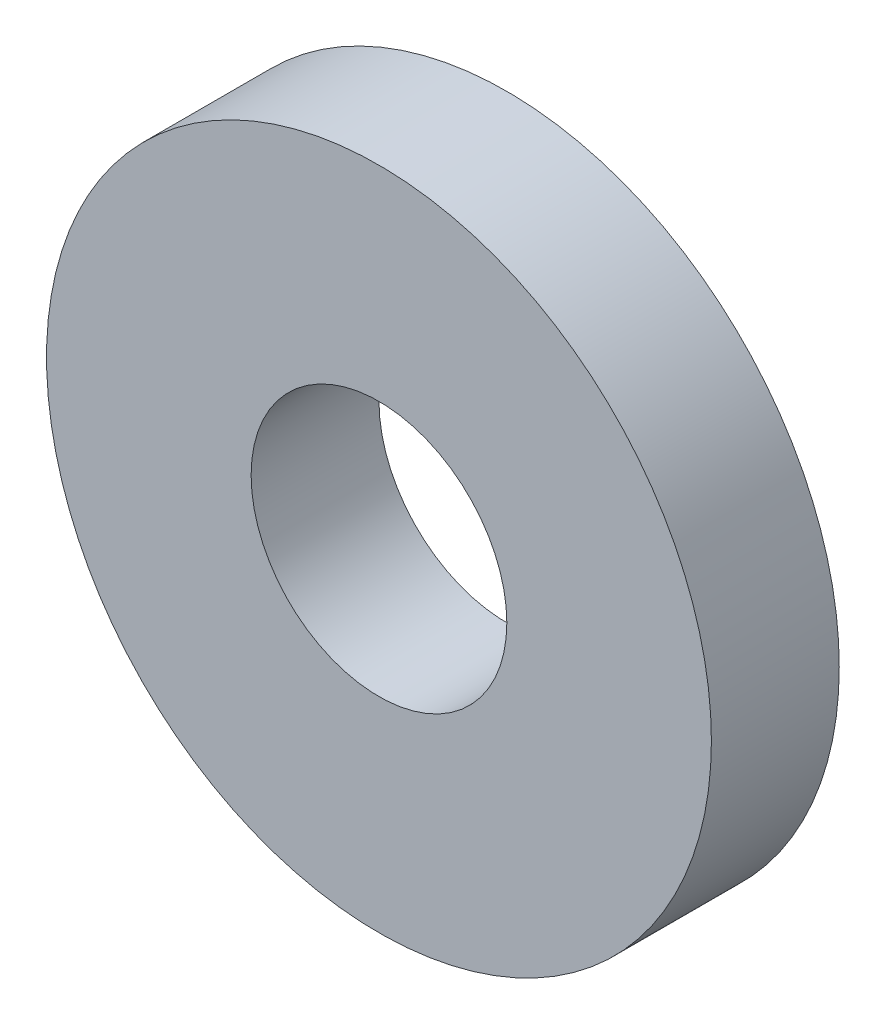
from build123d import *

# Parameters (mm, degrees)
ESQUISSE1_R             = 13
BOSS_EXTRU_1_DEPTH      = 5
ESQUISSE2_R             = 5
ENL_V_MAT_EXTRU_1_DEPTH = 5


with BuildPart() as part:
    # Esquisse1 → Boss.-Extru.1 (new body)
    with BuildSketch(Plane.XY):
        with Locations((-54.278457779, 4.647556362)):
            Circle(ESQUISSE1_R)
    extrude(amount=BOSS_EXTRU_1_DEPTH)

    # Esquisse2 → Enl_v. mat.-Extru.1 (cut)
    with BuildSketch(Plane.XY.offset(5)):
        with Locations((-54.278457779, 4.647556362)):
            Circle(ESQUISSE2_R)
    extrude(amount=-ENL_V_MAT_EXTRU_1_DEPTH, mode=Mode.SUBTRACT)


solid = part.part
